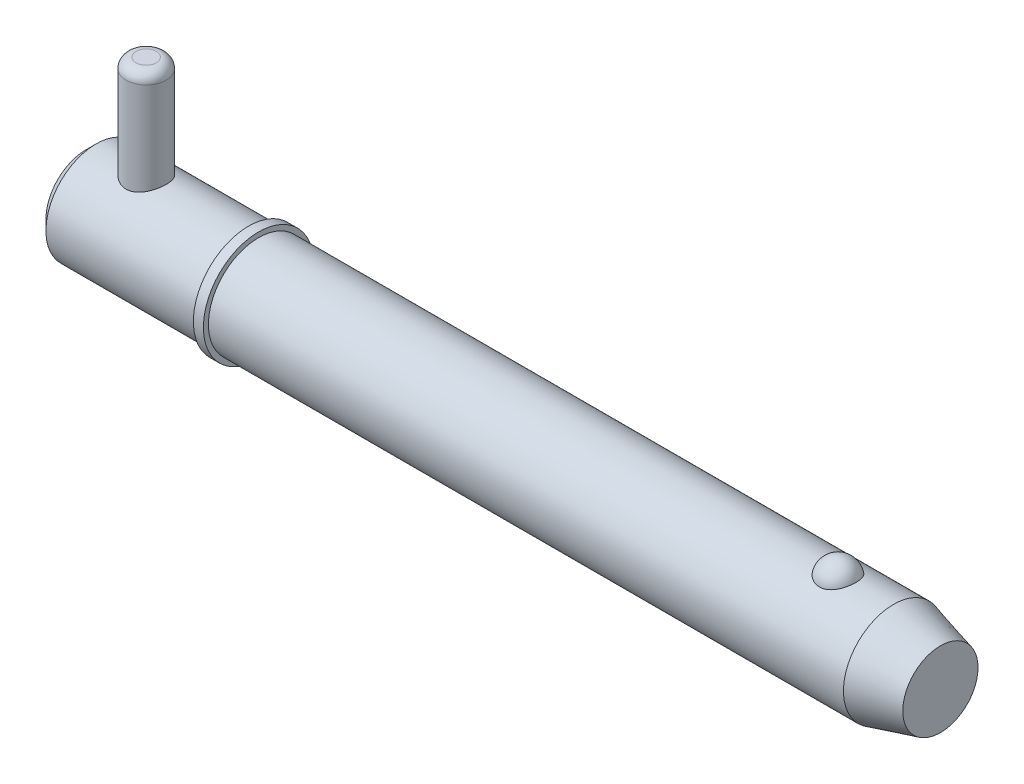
ISO-10303-21;
HEADER;
FILE_DESCRIPTION(('STEP AP214'),'2;1');
FILE_NAME('part.step','',(''),(''),'','','');
FILE_SCHEMA(('AUTOMOTIVE_DESIGN { 1 0 10303 214 1 1 1 1 }'));
ENDSEC;
DATA;
#1=APPLICATION_CONTEXT('core data for automotive mechanical design processes');
#2=APPLICATION_PROTOCOL_DEFINITION('international standard','automotive_design',2000,#1);
#3=PRODUCT_CONTEXT('',#1,'mechanical');
#4=PRODUCT('Part','Part','',(#3));
#5=PRODUCT_RELATED_PRODUCT_CATEGORY('part','',(#4));
#6=PRODUCT_DEFINITION_FORMATION('','',#4);
#7=PRODUCT_DEFINITION_CONTEXT('part definition',#1,'design');
#8=PRODUCT_DEFINITION('design','',#6,#7);
#9=PRODUCT_DEFINITION_SHAPE('','',#8);
#10=(LENGTH_UNIT() NAMED_UNIT(*) SI_UNIT(.MILLI.,.METRE.));
#11=(NAMED_UNIT(*) PLANE_ANGLE_UNIT() SI_UNIT($,.RADIAN.));
#12=(NAMED_UNIT(*) SI_UNIT($,.STERADIAN.) SOLID_ANGLE_UNIT());
#13=UNCERTAINTY_MEASURE_WITH_UNIT(LENGTH_MEASURE(1.E-05),#10,'distance_accuracy_value','');
#14=(GEOMETRIC_REPRESENTATION_CONTEXT(3) GLOBAL_UNCERTAINTY_ASSIGNED_CONTEXT((#13)) GLOBAL_UNIT_ASSIGNED_CONTEXT((#10,
#11,#12)) REPRESENTATION_CONTEXT('',''));
#15=CARTESIAN_POINT('',(0.,0.,0.));
#16=DIRECTION('',(0.,0.,1.));
#17=DIRECTION('',(1.,0.,0.));
#18=AXIS2_PLACEMENT_3D('',#15,#16,#17);
#19=CARTESIAN_POINT('',(9.525,23.81,0.));
#20=DIRECTION('',(0.,-1.,0.));
#21=DIRECTION('',(0.,0.,-1.));
#22=AXIS2_PLACEMENT_3D('',#19,#20,#21);
#23=CYLINDRICAL_SURFACE('',#22,3.175);
#24=CARTESIAN_POINT('',(9.525,-6.3525,0.));
#25=DIRECTION('',(0.,1.,0.));
#26=DIRECTION('',(0.,0.,1.));
#27=AXIS2_PLACEMENT_3D('',#24,#25,#26);
#28=CIRCLE('',#27,3.175);
#29=CARTESIAN_POINT('',(9.525,-6.3525,3.175));
#30=VERTEX_POINT('',#29);
#31=EDGE_CURVE('P0_E25',#30,#30,#28,.T.);
#32=ORIENTED_EDGE('',*,*,#31,.T.);
#33=EDGE_LOOP('',(#32));
#34=FACE_BOUND('',#33,.T.);
#35=CARTESIAN_POINT('',(9.525,22.2225,0.));
#36=DIRECTION('',(0.,1.,0.));
#37=DIRECTION('',(0.,0.,1.));
#38=AXIS2_PLACEMENT_3D('',#35,#36,#37);
#39=CIRCLE('',#38,3.175);
#40=CARTESIAN_POINT('',(9.525,22.2225,3.175));
#41=VERTEX_POINT('',#40);
#42=EDGE_CURVE('P0_E29',#41,#41,#39,.F.);
#43=ORIENTED_EDGE('',*,*,#42,.T.);
#44=EDGE_LOOP('',(#43));
#45=FACE_BOUND('',#44,.T.);
#46=ADVANCED_FACE('P0_F14',(#34,#45),#23,.T.);
#47=CARTESIAN_POINT('',(9.525,23.81,0.));
#48=DIRECTION('',(0.,1.,0.));
#49=DIRECTION('',(0.,0.,1.));
#50=AXIS2_PLACEMENT_3D('',#47,#48,#49);
#51=PLANE('',#50);
#52=CARTESIAN_POINT('',(9.525,23.81,0.));
#53=DIRECTION('',(0.,1.,0.));
#54=DIRECTION('',(0.,0.,1.));
#55=AXIS2_PLACEMENT_3D('',#52,#53,#54);
#56=CIRCLE('',#55,1.5875);
#57=CARTESIAN_POINT('',(9.525,23.81,1.5875));
#58=VERTEX_POINT('',#57);
#59=EDGE_CURVE('P0_E10',#58,#58,#56,.T.);
#60=ORIENTED_EDGE('',*,*,#59,.T.);
#61=EDGE_LOOP('',(#60));
#62=FACE_BOUND('',#61,.T.);
#63=ADVANCED_FACE('P0_F46',(#62),#51,.T.);
#64=CARTESIAN_POINT('',(9.525,-7.94,0.));
#65=DIRECTION('',(0.,1.,0.));
#66=DIRECTION('',(0.,0.,1.));
#67=AXIS2_PLACEMENT_3D('',#64,#65,#66);
#68=PLANE('',#67);
#69=CARTESIAN_POINT('',(9.525,-7.94,0.));
#70=DIRECTION('',(0.,1.,0.));
#71=DIRECTION('',(0.,0.,1.));
#72=AXIS2_PLACEMENT_3D('',#69,#70,#71);
#73=CIRCLE('',#72,1.5875);
#74=CARTESIAN_POINT('',(9.525,-7.94,1.5875));
#75=VERTEX_POINT('',#74);
#76=EDGE_CURVE('P0_E21',#75,#75,#73,.F.);
#77=ORIENTED_EDGE('',*,*,#76,.T.);
#78=EDGE_LOOP('',(#77));
#79=FACE_BOUND('',#78,.T.);
#80=ADVANCED_FACE('P0_F43',(#79),#68,.F.);
#81=CARTESIAN_POINT('',(9.525,-6.3525,0.));
#82=DIRECTION('',(0.,1.,0.));
#83=DIRECTION('',(0.,0.,1.));
#84=AXIS2_PLACEMENT_3D('',#81,#82,#83);
#85=DEGENERATE_TOROIDAL_SURFACE('',#84,1.5875,1.5875,.T.);
#86=ORIENTED_EDGE('',*,*,#76,.F.);
#87=EDGE_LOOP('',(#86));
#88=FACE_BOUND('',#87,.T.);
#89=ORIENTED_EDGE('',*,*,#31,.F.);
#90=EDGE_LOOP('',(#89));
#91=FACE_BOUND('',#90,.T.);
#92=ADVANCED_FACE('P0_F38',(#88,#91),#85,.T.);
#93=CARTESIAN_POINT('',(9.525,22.2225,0.));
#94=DIRECTION('',(0.,1.,0.));
#95=DIRECTION('',(0.,0.,1.));
#96=AXIS2_PLACEMENT_3D('',#93,#94,#95);
#97=DEGENERATE_TOROIDAL_SURFACE('',#96,1.5875,1.5875,.T.);
#98=ORIENTED_EDGE('',*,*,#42,.F.);
#99=EDGE_LOOP('',(#98));
#100=FACE_BOUND('',#99,.T.);
#101=ORIENTED_EDGE('',*,*,#59,.F.);
#102=EDGE_LOOP('',(#101));
#103=FACE_BOUND('',#102,.T.);
#104=ADVANCED_FACE('P0_F16',(#100,#103),#97,.T.);
#105=CLOSED_SHELL('',(#46,#63,#80,#92,#104));
#106=MANIFOLD_SOLID_BREP('P0_B1',#105);
#107=CARTESIAN_POINT('',(0.,0.,0.));
#108=DIRECTION('',(1.,0.,0.));
#109=DIRECTION('',(0.,0.,-1.));
#110=AXIS2_PLACEMENT_3D('',#107,#108,#109);
#111=CYLINDRICAL_SURFACE('',#110,7.94);
#112=CARTESIAN_POINT('',(127.851879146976,0.,0.));
#113=DIRECTION('',(1.,0.,0.));
#114=DIRECTION('',(0.,0.,-1.));
#115=AXIS2_PLACEMENT_3D('',#112,#113,#114);
#116=CIRCLE('',#115,7.94);
#117=CARTESIAN_POINT('',(127.851879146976,0.,-7.94));
#118=VERTEX_POINT('',#117);
#119=EDGE_CURVE('P1_E81',#118,#118,#116,.T.);
#120=ORIENTED_EDGE('',*,*,#119,.F.);
#121=EDGE_LOOP('',(#120));
#122=FACE_BOUND('',#121,.T.);
#123=CARTESIAN_POINT('',(27.31,0.,0.));
#124=DIRECTION('',(1.,0.,0.));
#125=DIRECTION('',(0.,0.,-1.));
#126=AXIS2_PLACEMENT_3D('',#123,#124,#125);
#127=CIRCLE('',#126,7.94);
#128=CARTESIAN_POINT('',(27.31,0.,-7.94));
#129=VERTEX_POINT('',#128);
#130=EDGE_CURVE('P1_E85',#129,#129,#127,.T.);
#131=ORIENTED_EDGE('',*,*,#130,.T.);
#132=EDGE_LOOP('',(#131));
#133=FACE_BOUND('',#132,.T.);
#134=CARTESIAN_POINT('',(119.044907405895,7.37767842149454,2.93486986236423));
#135=CARTESIAN_POINT('',(118.892749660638,7.3776732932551,2.93487505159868));
#136=CARTESIAN_POINT('',(118.740632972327,7.38258419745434,2.92262454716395));
#137=CARTESIAN_POINT('',(118.440928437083,7.40163229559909,2.87404196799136));
#138=CARTESIAN_POINT('',(118.293339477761,7.41576720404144,2.83771585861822));
#139=CARTESIAN_POINT('',(118.007018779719,7.4516157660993,2.74218769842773));
#140=CARTESIAN_POINT('',(117.868274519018,7.47331841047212,2.68301886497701));
#141=CARTESIAN_POINT('',(117.602882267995,7.52194082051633,2.54350967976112));
#142=CARTESIAN_POINT('',(117.476236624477,7.5488615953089,2.46316523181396));
#143=CARTESIAN_POINT('',(117.234534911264,7.60594671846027,2.28090375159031));
#144=CARTESIAN_POINT('',(117.119906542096,7.63618114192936,2.17844211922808));
#145=CARTESIAN_POINT('',(116.908878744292,7.69614046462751,1.95608495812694));
#146=CARTESIAN_POINT('',(116.812482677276,7.72586526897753,1.83618622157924));
#147=CARTESIAN_POINT('',(116.635938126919,7.78314821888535,1.57628086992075));
#148=CARTESIAN_POINT('',(116.556707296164,7.81055035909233,1.43561546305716));
#149=CARTESIAN_POINT('',(116.421797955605,7.85879631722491,1.14236334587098));
#150=CARTESIAN_POINT('',(116.366121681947,7.87963951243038,0.989775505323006));
#151=CARTESIAN_POINT('',(116.27881215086,7.91289645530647,0.67461992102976));
#152=CARTESIAN_POINT('',(116.24753090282,7.925186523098,0.511941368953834));
#153=CARTESIAN_POINT('',(116.210975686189,7.93958930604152,0.183247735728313));
#154=CARTESIAN_POINT('',(116.205701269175,7.94170219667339,0.0172327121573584));
#155=CARTESIAN_POINT('',(116.221231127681,7.93554931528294,-0.312672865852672));
#156=CARTESIAN_POINT('',(116.241925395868,7.92732732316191,-0.4765694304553));
#157=CARTESIAN_POINT('',(116.30878655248,7.90141534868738,-0.79830524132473));
#158=CARTESIAN_POINT('',(116.354953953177,7.88372517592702,-0.956144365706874));
#159=CARTESIAN_POINT('',(116.471898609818,7.84066230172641,-1.26152073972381));
#160=CARTESIAN_POINT('',(116.542704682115,7.81528060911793,-1.40904568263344));
#161=CARTESIAN_POINT('',(116.707478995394,7.7594867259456,-1.68950598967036));
#162=CARTESIAN_POINT('',(116.801448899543,7.72907417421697,-1.82244030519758));
#163=CARTESIAN_POINT('',(117.010839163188,7.66640424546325,-2.07032792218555));
#164=CARTESIAN_POINT('',(117.126315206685,7.63414223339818,-2.1852330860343));
#165=CARTESIAN_POINT('',(117.3759006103,7.57149681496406,-2.39329737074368));
#166=CARTESIAN_POINT('',(117.510008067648,7.54111321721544,-2.48645870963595));
#167=CARTESIAN_POINT('',(117.790111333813,7.48650742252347,-2.64628132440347));
#168=CARTESIAN_POINT('',(117.935760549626,7.46215900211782,-2.71350554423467));
#169=CARTESIAN_POINT('',(118.237425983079,7.42171253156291,-2.82226614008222));
#170=CARTESIAN_POINT('',(118.393438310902,7.40561140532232,-2.86381209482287));
#171=CARTESIAN_POINT('',(118.702970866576,7.3842679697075,-2.9183907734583));
#172=CARTESIAN_POINT('',(118.856222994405,7.37852109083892,-2.93275024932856));
#173=CARTESIAN_POINT('',(119.163070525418,7.37700973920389,-2.93655208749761));
#174=CARTESIAN_POINT('',(119.316665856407,7.38124333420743,-2.92599927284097));
#175=CARTESIAN_POINT('',(119.614990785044,7.39890635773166,-2.88102897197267));
#176=CARTESIAN_POINT('',(119.759848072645,7.41205491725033,-2.84733999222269));
#177=CARTESIAN_POINT('',(120.04164329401,7.445801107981,-2.75788206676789));
#178=CARTESIAN_POINT('',(120.178580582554,7.46639934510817,-2.70211132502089));
#179=CARTESIAN_POINT('',(120.444061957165,7.51339098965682,-2.56858908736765));
#180=CARTESIAN_POINT('',(120.572354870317,7.53990200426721,-2.4903806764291));
#181=CARTESIAN_POINT('',(120.814244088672,7.59569503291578,-2.31462737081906));
#182=CARTESIAN_POINT('',(120.927837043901,7.62497767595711,-2.21707808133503));
#183=CARTESIAN_POINT('',(121.14322156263,7.68489473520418,-1.99982049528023));
#184=CARTESIAN_POINT('',(121.244148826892,7.71552419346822,-1.87925337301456));
#185=CARTESIAN_POINT('',(121.425186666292,7.77353016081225,-1.62268826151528));
#186=CARTESIAN_POINT('',(121.505293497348,7.80090608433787,-1.4866875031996));
#187=CARTESIAN_POINT('',(121.645361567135,7.85047992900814,-1.19818413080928));
#188=CARTESIAN_POINT('',(121.704587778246,7.8724818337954,-1.04529016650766));
#189=CARTESIAN_POINT('',(121.797982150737,7.90785114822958,-0.731080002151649));
#190=CARTESIAN_POINT('',(121.832149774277,7.92121837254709,-0.569763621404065));
#191=CARTESIAN_POINT('',(121.874795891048,7.93797834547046,-0.242812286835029));
#192=CARTESIAN_POINT('',(121.883204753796,7.94134405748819,-0.0771668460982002));
#193=CARTESIAN_POINT('',(121.873962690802,7.93767937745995,0.2532769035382));
#194=CARTESIAN_POINT('',(121.856312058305,7.93064910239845,0.418075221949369));
#195=CARTESIAN_POINT('',(121.795424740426,7.90695571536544,0.74152553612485));
#196=CARTESIAN_POINT('',(121.752281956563,7.8903279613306,0.900197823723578));
#197=CARTESIAN_POINT('',(121.64135358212,7.84916386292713,1.20759654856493));
#198=CARTESIAN_POINT('',(121.57356656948,7.82462706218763,1.35632241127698));
#199=CARTESIAN_POINT('',(121.414371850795,7.7700669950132,1.64032869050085));
#200=CARTESIAN_POINT('',(121.322861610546,7.7400200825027,1.77554712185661));
#201=CARTESIAN_POINT('',(121.118296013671,7.67774175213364,2.02800648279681));
#202=CARTESIAN_POINT('',(121.005241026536,7.64551037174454,2.14524772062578));
#203=CARTESIAN_POINT('',(120.760831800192,7.58265895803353,2.35778002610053));
#204=CARTESIAN_POINT('',(120.629583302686,7.5520309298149,2.45319004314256));
#205=CARTESIAN_POINT('',(120.351601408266,7.49579792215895,2.61999897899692));
#206=CARTESIAN_POINT('',(120.204867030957,7.47019326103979,2.69139637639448));
#207=CARTESIAN_POINT('',(119.892947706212,7.42622216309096,2.8105324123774));
#208=CARTESIAN_POINT('',(119.727220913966,7.40825002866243,2.85700910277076));
#209=CARTESIAN_POINT('',(119.389279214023,7.38398348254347,2.9191685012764));
#210=CARTESIAN_POINT('',(119.21706702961,7.3776842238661,2.93486399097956));
#211=CARTESIAN_POINT('',(119.044907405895,7.37767842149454,2.93486986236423));
#212=B_SPLINE_CURVE_WITH_KNOTS('',3,(#134,#135,#136,#137,#138,#139,#140,#141,#142,#143,#144,
#145,#146,#147,#148,#149,#150,#151,#152,#153,#154,#155,#156,#157,#158,#159,#160,#161,#162,#163,
#164,#165,#166,#167,#168,#169,#170,#171,#172,#173,#174,#175,#176,#177,#178,#179,#180,#181,#182,
#183,#184,#185,#186,#187,#188,#189,#190,#191,#192,#193,#194,#195,#196,#197,#198,#199,#200,#201,
#202,#203,#204,#205,#206,#207,#208,#209,#210,#211),.UNSPECIFIED.,.T.,.F.,(4,2,2,2,2,2,2,2,2,2,2,
2,2,2,2,2,2,2,2,2,2,2,2,2,2,2,2,2,2,2,2,2,2,2,2,2,2,2,4),(0.,0.45584132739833,0.911569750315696,
1.36663794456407,1.8217942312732,2.28978983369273,2.7578716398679,3.246853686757,
3.73588214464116,4.23184282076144,4.72779494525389,5.22165321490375,5.71552141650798,
6.20996917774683,6.70445245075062,7.20023431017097,7.69596557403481,8.18023418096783,
8.66432203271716,9.12410697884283,9.58380291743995,10.0296503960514,10.4755341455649,
10.9312349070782,11.3870393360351,11.8654416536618,12.3439299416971,12.8378875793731,
13.3318558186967,13.8271581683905,14.3224549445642,14.8159385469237,15.3094506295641,
15.8051323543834,16.3008055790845,16.7937101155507,17.2866458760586,17.8026240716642,
18.3183879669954),.UNSPECIFIED.);
#213=CARTESIAN_POINT('',(119.044907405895,7.37767842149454,2.93486986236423));
#214=VERTEX_POINT('',#213);
#215=EDGE_CURVE('P1_E35',#214,#214,#212,.T.);
#216=ORIENTED_EDGE('',*,*,#215,.T.);
#217=EDGE_LOOP('',(#216));
#218=FACE_BOUND('',#217,.T.);
#219=ADVANCED_FACE('P1_F13',(#122,#133,#218),#111,.T.);
#220=CARTESIAN_POINT('',(0.,0.,0.));
#221=DIRECTION('',(-1.,0.,0.));
#222=DIRECTION('',(0.,0.,1.));
#223=AXIS2_PLACEMENT_3D('',#220,#221,#222);
#224=PLANE('',#223);
#225=CARTESIAN_POINT('',(0.,0.,0.));
#226=DIRECTION('',(1.,0.,0.));
#227=DIRECTION('',(0.,0.,-1.));
#228=AXIS2_PLACEMENT_3D('',#225,#226,#227);
#229=CIRCLE('',#228,6.352);
#230=CARTESIAN_POINT('',(0.,0.,-6.352));
#231=VERTEX_POINT('',#230);
#232=EDGE_CURVE('P1_E9',#231,#231,#229,.T.);
#233=ORIENTED_EDGE('',*,*,#232,.F.);
#234=EDGE_LOOP('',(#233));
#235=FACE_BOUND('',#234,.T.);
#236=ADVANCED_FACE('P1_F15',(#235),#224,.T.);
#237=CARTESIAN_POINT('',(1.58799999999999,0.,0.));
#238=DIRECTION('',(1.,0.,0.));
#239=DIRECTION('',(0.,0.,-1.));
#240=AXIS2_PLACEMENT_3D('',#237,#238,#239);
#241=CONICAL_SURFACE('',#240,7.94,0.78539816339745);
#242=ORIENTED_EDGE('',*,*,#232,.T.);
#243=EDGE_LOOP('',(#242));
#244=FACE_BOUND('',#243,.T.);
#245=CARTESIAN_POINT('',(1.58799999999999,0.,0.));
#246=DIRECTION('',(1.,0.,0.));
#247=DIRECTION('',(0.,0.,-1.));
#248=AXIS2_PLACEMENT_3D('',#245,#246,#247);
#249=CIRCLE('',#248,7.94);
#250=CARTESIAN_POINT('',(1.58799999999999,0.,-7.94));
#251=VERTEX_POINT('',#250);
#252=EDGE_CURVE('P1_E26',#251,#251,#249,.T.);
#253=ORIENTED_EDGE('',*,*,#252,.F.);
#254=EDGE_LOOP('',(#253));
#255=FACE_BOUND('',#254,.T.);
#256=ADVANCED_FACE('P1_F77',(#244,#255),#241,.T.);
#257=CARTESIAN_POINT('',(0.,0.,0.));
#258=DIRECTION('',(1.,0.,0.));
#259=DIRECTION('',(0.,0.,-1.));
#260=AXIS2_PLACEMENT_3D('',#257,#258,#259);
#261=CYLINDRICAL_SURFACE('',#260,7.94);
#262=CARTESIAN_POINT('',(9.525,-7.27756655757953,3.175));
#263=CARTESIAN_POINT('',(9.43992346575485,-7.27756715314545,3.17499935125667));
#264=CARTESIAN_POINT('',(9.35481882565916,-7.27906496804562,3.1715736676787));
#265=CARTESIAN_POINT('',(9.18524505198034,-7.28499816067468,3.15791803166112));
#266=CARTESIAN_POINT('',(9.100776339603,-7.28943533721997,3.14768391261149));
#267=CARTESIAN_POINT('',(8.84895715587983,-7.30698881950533,3.10684226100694));
#268=CARTESIAN_POINT('',(8.6834173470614,-7.32434654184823,3.06609574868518));
#269=CARTESIAN_POINT('',(8.36278910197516,-7.36806950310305,2.95945910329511));
#270=CARTESIAN_POINT('',(8.20766386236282,-7.39440078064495,2.89366366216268));
#271=CARTESIAN_POINT('',(7.91065319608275,-7.45304562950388,2.73907413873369));
#272=CARTESIAN_POINT('',(7.76876488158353,-7.48535789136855,2.65028508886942));
#273=CARTESIAN_POINT('',(7.49411086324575,-7.55439482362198,2.44679888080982));
#274=CARTESIAN_POINT('',(7.36219910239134,-7.59126138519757,2.33099745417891));
#275=CARTESIAN_POINT('',(7.11904234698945,-7.66408045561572,2.07909838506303));
#276=CARTESIAN_POINT('',(7.00780457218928,-7.70003264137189,1.94299368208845));
#277=CARTESIAN_POINT('',(6.80492173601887,-7.76867514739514,1.64775981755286));
#278=CARTESIAN_POINT('',(6.71422139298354,-7.80118112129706,1.48793473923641));
#279=CARTESIAN_POINT('',(6.56135788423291,-7.85754918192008,1.15376269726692));
#280=CARTESIAN_POINT('',(6.49918311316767,-7.88141478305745,0.979421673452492));
#281=CARTESIAN_POINT('',(6.40818142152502,-7.91680873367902,0.630115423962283));
#282=CARTESIAN_POINT('',(6.3778864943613,-7.9288781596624,0.455588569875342));
#283=CARTESIAN_POINT('',(6.34677743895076,-7.94127547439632,0.103539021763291));
#284=CARTESIAN_POINT('',(6.34595232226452,-7.94160773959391,-0.0739825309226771));
#285=CARTESIAN_POINT('',(6.37300128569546,-7.93082261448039,-0.416371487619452));
#286=CARTESIAN_POINT('',(6.39926693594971,-7.92034690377,-0.581389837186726));
#287=CARTESIAN_POINT('',(6.47701615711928,-7.88998770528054,-0.904449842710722));
#288=CARTESIAN_POINT('',(6.52850157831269,-7.87010352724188,-1.06249098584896));
#289=CARTESIAN_POINT('',(6.65586120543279,-7.82249343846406,-1.36995769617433));
#290=CARTESIAN_POINT('',(6.73209124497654,-7.79465387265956,-1.51921754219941));
#291=CARTESIAN_POINT('',(6.90644286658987,-7.73389606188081,-1.80321183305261));
#292=CARTESIAN_POINT('',(7.00457194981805,-7.70097607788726,-1.93794127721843));
#293=CARTESIAN_POINT('',(7.22744086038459,-7.63084889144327,-2.19843606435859));
#294=CARTESIAN_POINT('',(7.35350432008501,-7.59350211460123,-2.3230330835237));
#295=CARTESIAN_POINT('',(7.62488266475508,-7.52039654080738,-2.54979642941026));
#296=CARTESIAN_POINT('',(7.77020381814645,-7.48463826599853,-2.65195542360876));
#297=CARTESIAN_POINT('',(8.08119298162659,-7.41780943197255,-2.83361305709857));
#298=CARTESIAN_POINT('',(8.24731937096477,-7.38689959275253,-2.91239105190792));
#299=CARTESIAN_POINT('',(8.59204539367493,-7.33515216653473,-3.04038913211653));
#300=CARTESIAN_POINT('',(8.77063684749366,-7.31430804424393,-3.08962840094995));
#301=CARTESIAN_POINT('',(9.12356982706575,-7.28663831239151,-3.15431018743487));
#302=CARTESIAN_POINT('',(9.29750494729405,-7.2790344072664,-3.17163284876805));
#303=CARTESIAN_POINT('',(9.64592502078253,-7.27648884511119,-3.17747282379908));
#304=CARTESIAN_POINT('',(9.82040979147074,-7.28154335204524,-3.16599886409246));
#305=CARTESIAN_POINT('',(10.1545374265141,-7.30294638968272,-3.11628310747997));
#306=CARTESIAN_POINT('',(10.3144598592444,-7.31863587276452,-3.0796016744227));
#307=CARTESIAN_POINT('',(10.625774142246,-7.35872371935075,-2.98253618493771));
#308=CARTESIAN_POINT('',(10.7771640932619,-7.38312401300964,-2.92214687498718));
#309=CARTESIAN_POINT('',(11.0739599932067,-7.4390944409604,-2.77664664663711));
#310=CARTESIAN_POINT('',(11.2188745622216,-7.47091513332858,-2.69063278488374));
#311=CARTESIAN_POINT('',(11.4928722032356,-7.53775867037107,-2.49724834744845));
#312=CARTESIAN_POINT('',(11.6219487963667,-7.57278281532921,-2.38986907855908));
#313=CARTESIAN_POINT('',(11.8705091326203,-7.64520845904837,-2.1474449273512));
#314=CARTESIAN_POINT('',(11.9885816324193,-7.68259462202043,-2.01094304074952));
#315=CARTESIAN_POINT('',(12.2003631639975,-7.75309951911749,-1.71917041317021));
#316=CARTESIAN_POINT('',(12.2940712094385,-7.78621808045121,-1.56389891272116));
#317=CARTESIAN_POINT('',(12.4541161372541,-7.84456050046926,-1.23845027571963));
#318=CARTESIAN_POINT('',(12.5204600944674,-7.86978639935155,-1.06827700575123));
#319=CARTESIAN_POINT('',(12.6231407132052,-7.90943635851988,-0.717928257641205));
#320=CARTESIAN_POINT('',(12.6594936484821,-7.92386627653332,-0.537758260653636));
#321=CARTESIAN_POINT('',(12.6992281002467,-7.93967263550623,-0.185201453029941));
#322=CARTESIAN_POINT('',(12.7046050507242,-7.94183891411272,-0.0130732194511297));
#323=CARTESIAN_POINT('',(12.6875036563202,-7.9350072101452,0.329549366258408));
#324=CARTESIAN_POINT('',(12.6650295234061,-7.92601091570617,0.500043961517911));
#325=CARTESIAN_POINT('',(12.5942896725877,-7.89825976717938,0.829196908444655));
#326=CARTESIAN_POINT('',(12.5468364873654,-7.87981280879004,0.988057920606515));
#327=CARTESIAN_POINT('',(12.4283390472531,-7.83513565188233,1.29553461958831));
#328=CARTESIAN_POINT('',(12.3572904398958,-7.8089040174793,1.44414841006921));
#329=CARTESIAN_POINT('',(12.1900822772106,-7.7497911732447,1.73412879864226));
#330=CARTESIAN_POINT('',(12.0929519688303,-7.71666737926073,1.87488510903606));
#331=CARTESIAN_POINT('',(11.8777894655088,-7.64775894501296,2.13869231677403));
#332=CARTESIAN_POINT('',(11.7597486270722,-7.61197320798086,2.26173585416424));
#333=CARTESIAN_POINT('',(11.4974896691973,-7.53902341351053,2.49449755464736));
#334=CARTESIAN_POINT('',(11.3521039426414,-7.50191102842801,2.60292060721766));
#335=CARTESIAN_POINT('',(11.0440201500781,-7.43289551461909,2.79392602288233));
#336=CARTESIAN_POINT('',(10.8813200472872,-7.40099299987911,2.87650534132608));
#337=CARTESIAN_POINT('',(10.558064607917,-7.3489506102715,3.00682739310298));
#338=CARTESIAN_POINT('',(10.398627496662,-7.32801197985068,3.05703164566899));
#339=CARTESIAN_POINT('',(10.0731242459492,-7.29639491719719,3.13175843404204));
#340=CARTESIAN_POINT('',(9.90707793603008,-7.28568789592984,3.15635254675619));
#341=CARTESIAN_POINT('',(9.70441566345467,-7.27968826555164,3.17013149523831));
#342=CARTESIAN_POINT('',(9.66856669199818,-7.27889378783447,3.17195593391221));
#343=CARTESIAN_POINT('',(9.59681348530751,-7.27783278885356,3.17439036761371));
#344=CARTESIAN_POINT('',(9.56090924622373,-7.27756630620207,3.17500027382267));
#345=CARTESIAN_POINT('',(9.525,-7.27756655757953,3.175));
#346=B_SPLINE_CURVE_WITH_KNOTS('',3,(#262,#263,#264,#265,#266,#267,#268,#269,#270,#271,#272,
#273,#274,#275,#276,#277,#278,#279,#280,#281,#282,#283,#284,#285,#286,#287,#288,#289,#290,#291,
#292,#293,#294,#295,#296,#297,#298,#299,#300,#301,#302,#303,#304,#305,#306,#307,#308,#309,#310,
#311,#312,#313,#314,#315,#316,#317,#318,#319,#320,#321,#322,#323,#324,#325,#326,#327,#328,#329,
#330,#331,#332,#333,#334,#335,#336,#337,#338,#339,#340,#341,#342,#343,#344,#345),.UNSPECIFIED.,
.T.,.F.,(4,2,2,2,2,2,2,2,2,2,2,2,2,2,2,2,2,2,2,2,2,2,2,2,2,2,2,2,2,2,2,2,2,2,2,2,2,2,2,2,2,4),
(0.,0.255187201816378,0.510530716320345,1.0218798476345,1.53131482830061,2.04063840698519,
2.57635929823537,3.11226692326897,3.66929090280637,4.22608806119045,4.75594400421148,
5.28560237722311,5.78552836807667,6.28549104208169,6.79298787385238,7.30065880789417,
7.8416422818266,8.38280228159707,8.93923025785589,9.49529647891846,10.0174074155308,
10.5393601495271,11.0316114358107,11.5239718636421,12.0362920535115,12.5488211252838,
13.0991799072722,13.6495609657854,14.1997996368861,14.7497395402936,15.2638187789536,
15.7778202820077,16.2760504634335,16.7743726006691,17.294711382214,17.8152657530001,
18.3680208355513,18.9208410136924,19.4240423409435,19.9258334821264,20.0335354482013,
20.1412452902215),.UNSPECIFIED.);
#347=CARTESIAN_POINT('',(9.525,-7.27756655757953,3.175));
#348=VERTEX_POINT('',#347);
#349=EDGE_CURVE('P1_E17',#348,#348,#346,.T.);
#350=ORIENTED_EDGE('',*,*,#349,.F.);
#351=EDGE_LOOP('',(#350));
#352=FACE_BOUND('',#351,.T.);
#353=CARTESIAN_POINT('',(9.525,7.27756655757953,3.175));
#354=CARTESIAN_POINT('',(9.61007653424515,7.27756715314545,3.17499935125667));
#355=CARTESIAN_POINT('',(9.69518117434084,7.27906496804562,3.1715736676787));
#356=CARTESIAN_POINT('',(9.86475494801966,7.28499816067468,3.15791803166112));
#357=CARTESIAN_POINT('',(9.949223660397,7.28943533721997,3.14768391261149));
#358=CARTESIAN_POINT('',(10.2010428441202,7.30698881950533,3.10684226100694));
#359=CARTESIAN_POINT('',(10.3665826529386,7.32434654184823,3.06609574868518));
#360=CARTESIAN_POINT('',(10.6872108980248,7.36806950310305,2.95945910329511));
#361=CARTESIAN_POINT('',(10.8423361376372,7.39440078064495,2.89366366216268));
#362=CARTESIAN_POINT('',(11.1393468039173,7.45304562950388,2.73907413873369));
#363=CARTESIAN_POINT('',(11.2812351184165,7.48535789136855,2.65028508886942));
#364=CARTESIAN_POINT('',(11.5558891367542,7.55439482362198,2.44679888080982));
#365=CARTESIAN_POINT('',(11.6878008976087,7.59126138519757,2.33099745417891));
#366=CARTESIAN_POINT('',(11.9309576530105,7.66408045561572,2.07909838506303));
#367=CARTESIAN_POINT('',(12.0421954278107,7.70003264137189,1.94299368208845));
#368=CARTESIAN_POINT('',(12.2450782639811,7.76867514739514,1.64775981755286));
#369=CARTESIAN_POINT('',(12.3357786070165,7.80118112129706,1.48793473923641));
#370=CARTESIAN_POINT('',(12.4886421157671,7.85754918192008,1.15376269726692));
#371=CARTESIAN_POINT('',(12.5508168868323,7.88141478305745,0.979421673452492));
#372=CARTESIAN_POINT('',(12.641818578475,7.91680873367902,0.630115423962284));
#373=CARTESIAN_POINT('',(12.6721135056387,7.9288781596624,0.455588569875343));
#374=CARTESIAN_POINT('',(12.7032225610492,7.94127547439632,0.103539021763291));
#375=CARTESIAN_POINT('',(12.7040476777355,7.94160773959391,-0.0739825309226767));
#376=CARTESIAN_POINT('',(12.6769987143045,7.93082261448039,-0.416371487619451));
#377=CARTESIAN_POINT('',(12.6507330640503,7.92034690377,-0.581389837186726));
#378=CARTESIAN_POINT('',(12.5729838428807,7.88998770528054,-0.904449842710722));
#379=CARTESIAN_POINT('',(12.5214984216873,7.87010352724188,-1.06249098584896));
#380=CARTESIAN_POINT('',(12.3941387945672,7.82249343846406,-1.36995769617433));
#381=CARTESIAN_POINT('',(12.3179087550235,7.79465387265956,-1.51921754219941));
#382=CARTESIAN_POINT('',(12.1435571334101,7.73389606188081,-1.80321183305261));
#383=CARTESIAN_POINT('',(12.0454280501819,7.70097607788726,-1.93794127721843));
#384=CARTESIAN_POINT('',(11.8225591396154,7.63084889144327,-2.19843606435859));
#385=CARTESIAN_POINT('',(11.696495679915,7.59350211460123,-2.3230330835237));
#386=CARTESIAN_POINT('',(11.4251173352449,7.52039654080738,-2.54979642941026));
#387=CARTESIAN_POINT('',(11.2797961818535,7.48463826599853,-2.65195542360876));
#388=CARTESIAN_POINT('',(10.9688070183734,7.41780943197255,-2.83361305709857));
#389=CARTESIAN_POINT('',(10.8026806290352,7.38689959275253,-2.91239105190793));
#390=CARTESIAN_POINT('',(10.4579546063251,7.33515216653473,-3.04038913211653));
#391=CARTESIAN_POINT('',(10.2793631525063,7.31430804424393,-3.08962840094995));
#392=CARTESIAN_POINT('',(9.92643017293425,7.28663831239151,-3.15431018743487));
#393=CARTESIAN_POINT('',(9.75249505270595,7.2790344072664,-3.17163284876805));
#394=CARTESIAN_POINT('',(9.40407497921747,7.2764888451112,-3.17747282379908));
#395=CARTESIAN_POINT('',(9.22959020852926,7.28154335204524,-3.16599886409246));
#396=CARTESIAN_POINT('',(8.89546257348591,7.30294638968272,-3.11628310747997));
#397=CARTESIAN_POINT('',(8.73554014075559,7.31863587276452,-3.0796016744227));
#398=CARTESIAN_POINT('',(8.42422585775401,7.35872371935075,-2.98253618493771));
#399=CARTESIAN_POINT('',(8.27283590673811,7.38312401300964,-2.92214687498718));
#400=CARTESIAN_POINT('',(7.97604000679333,7.4390944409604,-2.77664664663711));
#401=CARTESIAN_POINT('',(7.83112543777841,7.47091513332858,-2.69063278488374));
#402=CARTESIAN_POINT('',(7.55712779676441,7.53775867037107,-2.49724834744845));
#403=CARTESIAN_POINT('',(7.42805120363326,7.57278281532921,-2.38986907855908));
#404=CARTESIAN_POINT('',(7.17949086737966,7.64520845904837,-2.1474449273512));
#405=CARTESIAN_POINT('',(7.06141836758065,7.68259462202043,-2.01094304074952));
#406=CARTESIAN_POINT('',(6.8496368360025,7.75309951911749,-1.71917041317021));
#407=CARTESIAN_POINT('',(6.75592879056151,7.78621808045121,-1.56389891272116));
#408=CARTESIAN_POINT('',(6.59588386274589,7.84456050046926,-1.23845027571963));
#409=CARTESIAN_POINT('',(6.52953990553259,7.86978639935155,-1.06827700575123));
#410=CARTESIAN_POINT('',(6.42685928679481,7.90943635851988,-0.717928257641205));
#411=CARTESIAN_POINT('',(6.39050635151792,7.92386627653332,-0.537758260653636));
#412=CARTESIAN_POINT('',(6.35077189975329,7.93967263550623,-0.18520145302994));
#413=CARTESIAN_POINT('',(6.34539494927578,7.94183891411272,-0.0130732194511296));
#414=CARTESIAN_POINT('',(6.36249634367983,7.9350072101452,0.329549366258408));
#415=CARTESIAN_POINT('',(6.38497047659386,7.92601091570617,0.500043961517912));
#416=CARTESIAN_POINT('',(6.45571032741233,7.89825976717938,0.829196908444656));
#417=CARTESIAN_POINT('',(6.50316351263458,7.87981280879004,0.988057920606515));
#418=CARTESIAN_POINT('',(6.62166095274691,7.83513565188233,1.29553461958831));
#419=CARTESIAN_POINT('',(6.69270956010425,7.8089040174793,1.44414841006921));
#420=CARTESIAN_POINT('',(6.85991772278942,7.7497911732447,1.73412879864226));
#421=CARTESIAN_POINT('',(6.95704803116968,7.71666737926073,1.87488510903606));
#422=CARTESIAN_POINT('',(7.17221053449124,7.64775894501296,2.13869231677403));
#423=CARTESIAN_POINT('',(7.29025137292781,7.61197320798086,2.26173585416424));
#424=CARTESIAN_POINT('',(7.55251033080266,7.53902341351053,2.49449755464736));
#425=CARTESIAN_POINT('',(7.69789605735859,7.50191102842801,2.60292060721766));
#426=CARTESIAN_POINT('',(8.00597984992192,7.43289551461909,2.79392602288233));
#427=CARTESIAN_POINT('',(8.16867995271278,7.40099299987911,2.87650534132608));
#428=CARTESIAN_POINT('',(8.49193539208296,7.3489506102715,3.00682739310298));
#429=CARTESIAN_POINT('',(8.65137250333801,7.32801197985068,3.05703164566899));
#430=CARTESIAN_POINT('',(8.97687575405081,7.29639491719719,3.13175843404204));
#431=CARTESIAN_POINT('',(9.14292206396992,7.28568789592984,3.15635254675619));
#432=CARTESIAN_POINT('',(9.34558433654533,7.27968826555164,3.17013149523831));
#433=CARTESIAN_POINT('',(9.38143330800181,7.27889378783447,3.17195593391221));
#434=CARTESIAN_POINT('',(9.45318651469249,7.27783278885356,3.17439036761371));
#435=CARTESIAN_POINT('',(9.48909075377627,7.27756630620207,3.17500027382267));
#436=CARTESIAN_POINT('',(9.525,7.27756655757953,3.175));
#437=B_SPLINE_CURVE_WITH_KNOTS('',3,(#353,#354,#355,#356,#357,#358,#359,#360,#361,#362,#363,
#364,#365,#366,#367,#368,#369,#370,#371,#372,#373,#374,#375,#376,#377,#378,#379,#380,#381,#382,
#383,#384,#385,#386,#387,#388,#389,#390,#391,#392,#393,#394,#395,#396,#397,#398,#399,#400,#401,
#402,#403,#404,#405,#406,#407,#408,#409,#410,#411,#412,#413,#414,#415,#416,#417,#418,#419,#420,
#421,#422,#423,#424,#425,#426,#427,#428,#429,#430,#431,#432,#433,#434,#435,#436),.UNSPECIFIED.,
.T.,.F.,(4,2,2,2,2,2,2,2,2,2,2,2,2,2,2,2,2,2,2,2,2,2,2,2,2,2,2,2,2,2,2,2,2,2,2,2,2,2,2,2,2,4),
(0.,0.255187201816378,0.510530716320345,1.0218798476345,1.53131482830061,2.04063840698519,
2.57635929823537,3.11226692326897,3.66929090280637,4.22608806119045,4.75594400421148,
5.2856023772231,5.78552836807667,6.28549104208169,6.79298787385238,7.30065880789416,
7.8416422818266,8.38280228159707,8.9392302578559,9.49529647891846,10.0174074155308,
10.5393601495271,11.0316114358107,11.5239718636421,12.0362920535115,12.5488211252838,
13.0991799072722,13.6495609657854,14.1997996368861,14.7497395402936,15.2638187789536,
15.7778202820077,16.2760504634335,16.7743726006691,17.294711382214,17.8152657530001,
18.3680208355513,18.9208410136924,19.4240423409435,19.9258334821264,20.0335354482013,
20.1412452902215),.UNSPECIFIED.);
#438=CARTESIAN_POINT('',(9.525,7.27756655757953,3.175));
#439=VERTEX_POINT('',#438);
#440=EDGE_CURVE('P1_E43',#439,#439,#437,.T.);
#441=ORIENTED_EDGE('',*,*,#440,.F.);
#442=EDGE_LOOP('',(#441));
#443=FACE_BOUND('',#442,.T.);
#444=ORIENTED_EDGE('',*,*,#252,.T.);
#445=EDGE_LOOP('',(#444));
#446=FACE_BOUND('',#445,.T.);
#447=CARTESIAN_POINT('',(25.722,0.,0.));
#448=DIRECTION('',(1.,0.,0.));
#449=DIRECTION('',(0.,0.,-1.));
#450=AXIS2_PLACEMENT_3D('',#447,#448,#449);
#451=CIRCLE('',#450,7.94);
#452=CARTESIAN_POINT('',(25.722,0.,-7.94));
#453=VERTEX_POINT('',#452);
#454=EDGE_CURVE('P1_E31',#453,#453,#451,.T.);
#455=ORIENTED_EDGE('',*,*,#454,.F.);
#456=EDGE_LOOP('',(#455));
#457=FACE_BOUND('',#456,.T.);
#458=ADVANCED_FACE('P1_F103',(#352,#443,#446,#457),#261,.T.);
#459=CARTESIAN_POINT('',(25.722,7.94,0.));
#460=DIRECTION('',(-1.,0.,0.));
#461=DIRECTION('',(0.,0.,1.));
#462=AXIS2_PLACEMENT_3D('',#459,#460,#461);
#463=PLANE('',#462);
#464=ORIENTED_EDGE('',*,*,#454,.T.);
#465=EDGE_LOOP('',(#464));
#466=FACE_BOUND('',#465,.T.);
#467=CARTESIAN_POINT('',(25.722,0.,0.));
#468=DIRECTION('',(1.,0.,0.));
#469=DIRECTION('',(0.,0.,-1.));
#470=AXIS2_PLACEMENT_3D('',#467,#468,#469);
#471=CIRCLE('',#470,8.734);
#472=CARTESIAN_POINT('',(25.722,0.,-8.734));
#473=VERTEX_POINT('',#472);
#474=EDGE_CURVE('P1_E91',#473,#473,#471,.T.);
#475=ORIENTED_EDGE('',*,*,#474,.F.);
#476=EDGE_LOOP('',(#475));
#477=FACE_BOUND('',#476,.T.);
#478=ADVANCED_FACE('P1_F100',(#466,#477),#463,.T.);
#479=CARTESIAN_POINT('',(0.,0.,0.));
#480=DIRECTION('',(1.,0.,0.));
#481=DIRECTION('',(0.,0.,-1.));
#482=AXIS2_PLACEMENT_3D('',#479,#480,#481);
#483=CYLINDRICAL_SURFACE('',#482,8.734);
#484=ORIENTED_EDGE('',*,*,#474,.T.);
#485=EDGE_LOOP('',(#484));
#486=FACE_BOUND('',#485,.T.);
#487=CARTESIAN_POINT('',(27.31,0.,0.));
#488=DIRECTION('',(1.,0.,0.));
#489=DIRECTION('',(0.,0.,-1.));
#490=AXIS2_PLACEMENT_3D('',#487,#488,#489);
#491=CIRCLE('',#490,8.734);
#492=CARTESIAN_POINT('',(27.31,0.,-8.734));
#493=VERTEX_POINT('',#492);
#494=EDGE_CURVE('P1_E88',#493,#493,#491,.T.);
#495=ORIENTED_EDGE('',*,*,#494,.F.);
#496=EDGE_LOOP('',(#495));
#497=FACE_BOUND('',#496,.T.);
#498=ADVANCED_FACE('P1_F68',(#486,#497),#483,.T.);
#499=CARTESIAN_POINT('',(27.31,8.734,0.));
#500=DIRECTION('',(1.,0.,0.));
#501=DIRECTION('',(0.,0.,-1.));
#502=AXIS2_PLACEMENT_3D('',#499,#500,#501);
#503=PLANE('',#502);
#504=ORIENTED_EDGE('',*,*,#494,.T.);
#505=EDGE_LOOP('',(#504));
#506=FACE_BOUND('',#505,.T.);
#507=ORIENTED_EDGE('',*,*,#130,.F.);
#508=EDGE_LOOP('',(#507));
#509=FACE_BOUND('',#508,.T.);
#510=ADVANCED_FACE('P1_F62',(#506,#509),#503,.T.);
#511=CARTESIAN_POINT('',(135.26,0.,0.));
#512=DIRECTION('',(-1.,0.,0.));
#513=DIRECTION('',(0.,0.,1.));
#514=AXIS2_PLACEMENT_3D('',#511,#512,#513);
#515=CONICAL_SURFACE('',#514,5.95500000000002,0.261799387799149);
#516=ORIENTED_EDGE('',*,*,#119,.T.);
#517=EDGE_LOOP('',(#516));
#518=FACE_BOUND('',#517,.T.);
#519=CARTESIAN_POINT('',(135.26,0.,0.));
#520=DIRECTION('',(1.,0.,0.));
#521=DIRECTION('',(0.,0.,-1.));
#522=AXIS2_PLACEMENT_3D('',#519,#520,#521);
#523=CIRCLE('',#522,5.95500000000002);
#524=CARTESIAN_POINT('',(135.26,0.,-5.95500000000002));
#525=VERTEX_POINT('',#524);
#526=EDGE_CURVE('P1_E42',#525,#525,#523,.T.);
#527=ORIENTED_EDGE('',*,*,#526,.F.);
#528=EDGE_LOOP('',(#527));
#529=FACE_BOUND('',#528,.T.);
#530=ADVANCED_FACE('P1_F59',(#518,#529),#515,.T.);
#531=CARTESIAN_POINT('',(135.26,5.95500000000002,0.));
#532=DIRECTION('',(1.,0.,0.));
#533=DIRECTION('',(0.,0.,-1.));
#534=AXIS2_PLACEMENT_3D('',#531,#532,#533);
#535=PLANE('',#534);
#536=ORIENTED_EDGE('',*,*,#526,.T.);
#537=EDGE_LOOP('',(#536));
#538=FACE_BOUND('',#537,.T.);
#539=ADVANCED_FACE('P1_F55',(#538),#535,.T.);
#540=CARTESIAN_POINT('',(119.044907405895,7.146,0.));
#541=DIRECTION('',(-1.,0.,0.));
#542=DIRECTION('',(0.,1.,0.));
#543=AXIS2_PLACEMENT_3D('',#540,#541,#542);
#544=SPHERICAL_SURFACE('',#543,2.944);
#545=ORIENTED_EDGE('',*,*,#215,.F.);
#546=EDGE_LOOP('',(#545));
#547=FACE_BOUND('',#546,.T.);
#548=ADVANCED_FACE('P1_F50',(#547),#544,.T.);
#549=CARTESIAN_POINT('',(9.525,-8.734,0.));
#550=DIRECTION('',(0.,1.,0.));
#551=DIRECTION('',(0.,0.,1.));
#552=AXIS2_PLACEMENT_3D('',#549,#550,#551);
#553=CYLINDRICAL_SURFACE('',#552,3.175);
#554=ORIENTED_EDGE('',*,*,#349,.T.);
#555=EDGE_LOOP('',(#554));
#556=FACE_BOUND('',#555,.T.);
#557=ORIENTED_EDGE('',*,*,#440,.T.);
#558=EDGE_LOOP('',(#557));
#559=FACE_BOUND('',#558,.T.);
#560=ADVANCED_FACE('P1_F54',(#556,#559),#553,.F.);
#561=CLOSED_SHELL('',(#219,#236,#256,#458,#478,#498,#510,#530,#539,#548,#560));
#562=MANIFOLD_SOLID_BREP('P1_B1',#561);
#563=ADVANCED_BREP_SHAPE_REPRESENTATION('',(#18,#106,#562),#14);
#564=SHAPE_DEFINITION_REPRESENTATION(#9,#563);
ENDSEC;
END-ISO-10303-21;
